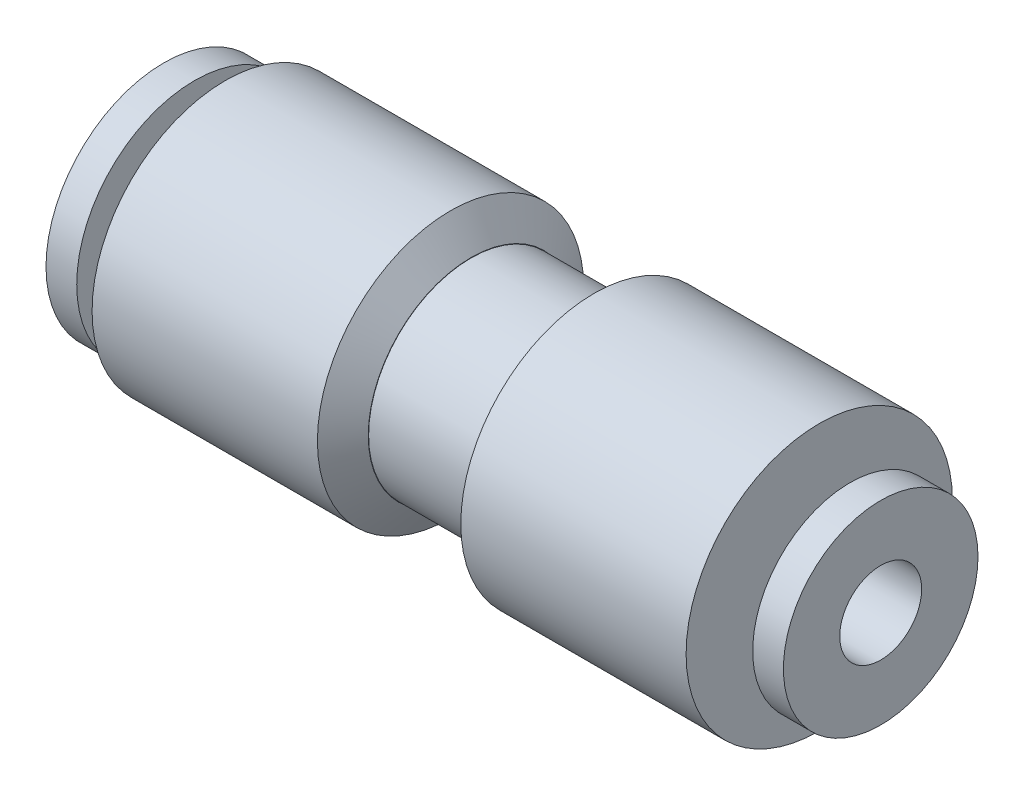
from build123d import *
from OCP.BRepFilletAPI import BRepFilletAPI_MakeChamfer

# Parameters (mm, degrees)
SKETCH1_R           = 6.5
BOSS_EXTRUDE1_DEPTH = 12
SKETCH2_R           = 5
BOSS_EXTRUDE2_DEPTH = 5
SKETCH3_R           = 6.5
BOSS_EXTRUDE3_DEPTH = 12
SKETCH4_R           = 2.5
BOSS_EXTRUDE4_DEPTH = 1.5
SKETCH5_R           = 4.75
BOSS_EXTRUDE5_DEPTH = 1.5
SKETCH6_R           = 3.5
BOSS_EXTRUDE6_DEPTH = 1.5
SKETCH7_R           = 5.75
BOSS_EXTRUDE7_DEPTH = 1.5
SKETCH8_R           = 3
CUT_EXTRUDE1_DEPTH  = 17.5
SKETCH9_R           = 2
CUT_EXTRUDE2_DEPTH  = 17.5
CHAMFER3_SIZE       = 1
CHAMFER3_SIZE2      = 1.482560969


with BuildPart() as part:
    # Sketch1 → Boss-Extrude1 (new body)
    with BuildSketch(Plane(origin=(0, 0, 0), x_dir=(0, 0, -1), z_dir=(1, 0, 0))):
        Circle(SKETCH1_R)
    extrude(amount=BOSS_EXTRUDE1_DEPTH)

    # Sketch2 → Boss-Extrude2 (add)
    with BuildSketch(Plane(origin=(12, 0, 0), x_dir=(0, 0, -1), z_dir=(1, 0, 0))):
        Circle(SKETCH2_R)
    extrude(amount=BOSS_EXTRUDE2_DEPTH)

    # Sketch3 → Boss-Extrude3 (add)
    with BuildSketch(Plane(origin=(17, 0, 0), x_dir=(0, 0, -1), z_dir=(1, 0, 0))):
        Circle(SKETCH3_R)
    extrude(amount=BOSS_EXTRUDE3_DEPTH)

    # Sketch4 → Boss-Extrude4 (add)
    with BuildSketch(Plane(origin=(29, 0, 0), x_dir=(0, 0, -1), z_dir=(1, 0, 0))):
        Circle(SKETCH4_R)
    extrude(amount=BOSS_EXTRUDE4_DEPTH)

    # Sketch5 → Boss-Extrude5 (add)
    with BuildSketch(Plane(origin=(30.5, 0, 0), x_dir=(0, 0, -1), z_dir=(1, 0, 0))):
        Circle(SKETCH5_R)
    extrude(amount=BOSS_EXTRUDE5_DEPTH)

    # Sketch6 → Boss-Extrude6 (add)
    with BuildSketch(Plane.ZY):
        with Locations(Location((0, 0, 0), (0, 0, 180))):
            Circle(SKETCH6_R)
    extrude(amount=BOSS_EXTRUDE6_DEPTH)

    # Sketch7 → Boss-Extrude7 (add)
    with BuildSketch(Plane.ZY.offset(1.5)):
        Circle(SKETCH7_R)
    extrude(amount=BOSS_EXTRUDE7_DEPTH)

    # Sketch8 → Cut-Extrude1 (cut)
    with BuildSketch(Plane.ZY.offset(3)):
        Circle(SKETCH8_R)
    extrude(amount=-CUT_EXTRUDE1_DEPTH, mode=Mode.SUBTRACT)

    # Sketch9 → Cut-Extrude2 (cut)
    with BuildSketch(Plane(origin=(32, 0, 0), x_dir=(0, 0, -1), z_dir=(1, 0, 0))):
        Circle(SKETCH9_R)
    extrude(amount=-CUT_EXTRUDE2_DEPTH, mode=Mode.SUBTRACT)

    # Chamfer3: one chamfer whose edges measure the first distance from different faces: ONE call of the kernel's chamfer builder (chamfer() names one face for all edges)
    chamfer3_edges_1 = [part.edges().sort_by_distance(p)[0] for p in [
        (12, 0, 6.5),
    ]]
    chamfer3_side_1 = [part.faces().sort_by_distance(p)[0] for p in [
        (6, 0, 6.5),
    ]]
    chamfer3_edges_2 = [part.edges().sort_by_distance(p)[0] for p in [
        (17, 0, 6.5),
    ]]
    chamfer3_side_2 = [part.faces().sort_by_distance(p)[0] for p in [
        (23, 0, 6.5),
    ]]
    chamfer3 = BRepFilletAPI_MakeChamfer(part.part.solid().wrapped)
    for e in chamfer3_edges_1:
        chamfer3.Add(CHAMFER3_SIZE, CHAMFER3_SIZE2, e.wrapped, chamfer3_side_1[0].wrapped)  # the first distance lies on this face
    for e in chamfer3_edges_2:
        chamfer3.Add(CHAMFER3_SIZE, CHAMFER3_SIZE2, e.wrapped, chamfer3_side_2[0].wrapped)  # the first distance lies on this face
    add(Compound.cast(chamfer3.Shape()), mode=Mode.REPLACE)


solid = part.part
